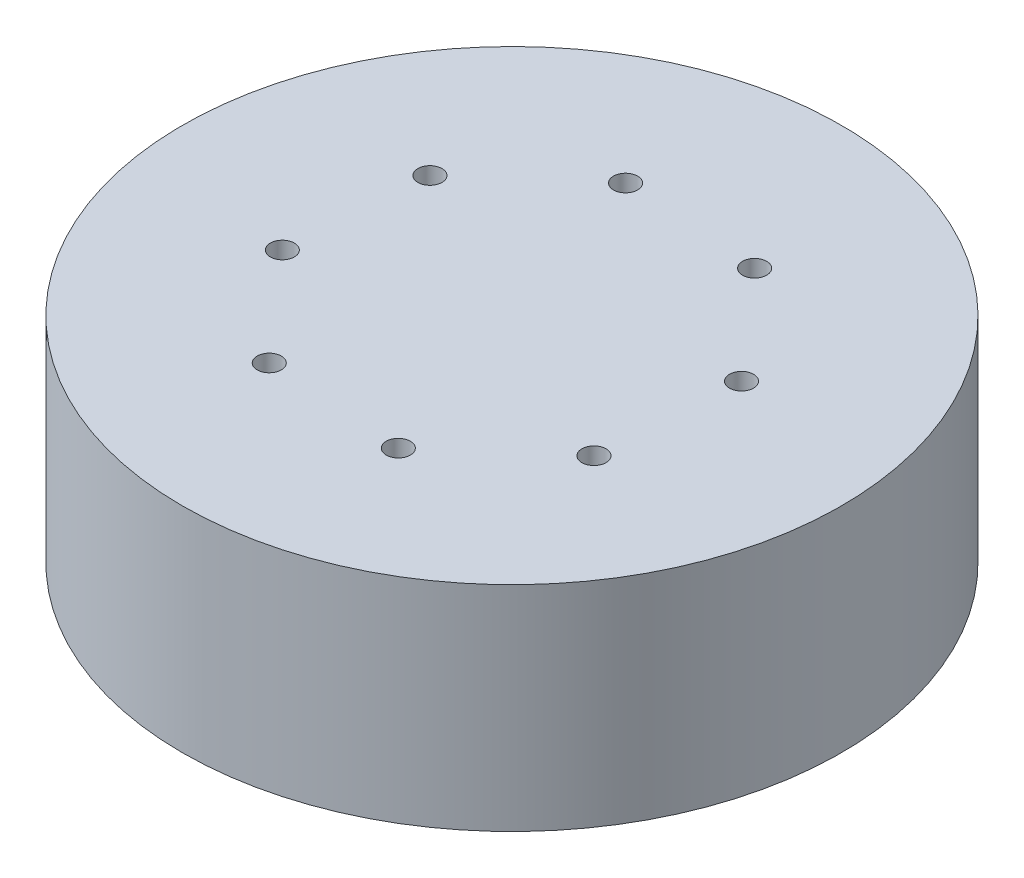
from build123d import *

# Parameters (mm, degrees)
SKIZZE1_R                       = 60.120883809
LINEAR_AUSTRAGEN1_DEPTH         = 39
SKIZZE3_R                       = 2.198608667
SCHNITT_LINEAR_AUSTRAGEN1_DEPTH = 94.541655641
KREISMUSTER1_COUNT              = 8


with BuildPart() as part:
    # Skizze1 → Linear austragen1 (new body)
    with BuildSketch(Plane(origin=(0, 0, 0), x_dir=(1, 0, 0), z_dir=(0, 1, 0))):
        with Locations(Location((0, 0, 0), (0, 0, 270))):
            Circle(SKIZZE1_R)
    extrude(amount=LINEAR_AUSTRAGEN1_DEPTH)

    # Skizze3 → Schnitt-Linear austragen1 (cut, through all)
    with BuildSketch(Plane(origin=(0, 39, 0), x_dir=(-1, 0, 0), z_dir=(0, 1, 0))):
        with Locations(Location((-14.654541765, -29.616173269, 0), (0, 0, 90))):
            Circle(SKIZZE3_R)
    schnitt_linear_austragen1 = extrude(amount=-SCHNITT_LINEAR_AUSTRAGEN1_DEPTH, mode=Mode.SUBTRACT)

    # Kreismuster1: Schnitt-Linear austragen1 ×8 about axis
    kreismuster1_axis = Axis((0, 0, 0), (0, 1, 0))
    for i in range(1, KREISMUSTER1_COUNT):
        add(schnitt_linear_austragen1.rotate(kreismuster1_axis, i * 360 / KREISMUSTER1_COUNT), mode=Mode.SUBTRACT)


solid = part.part
